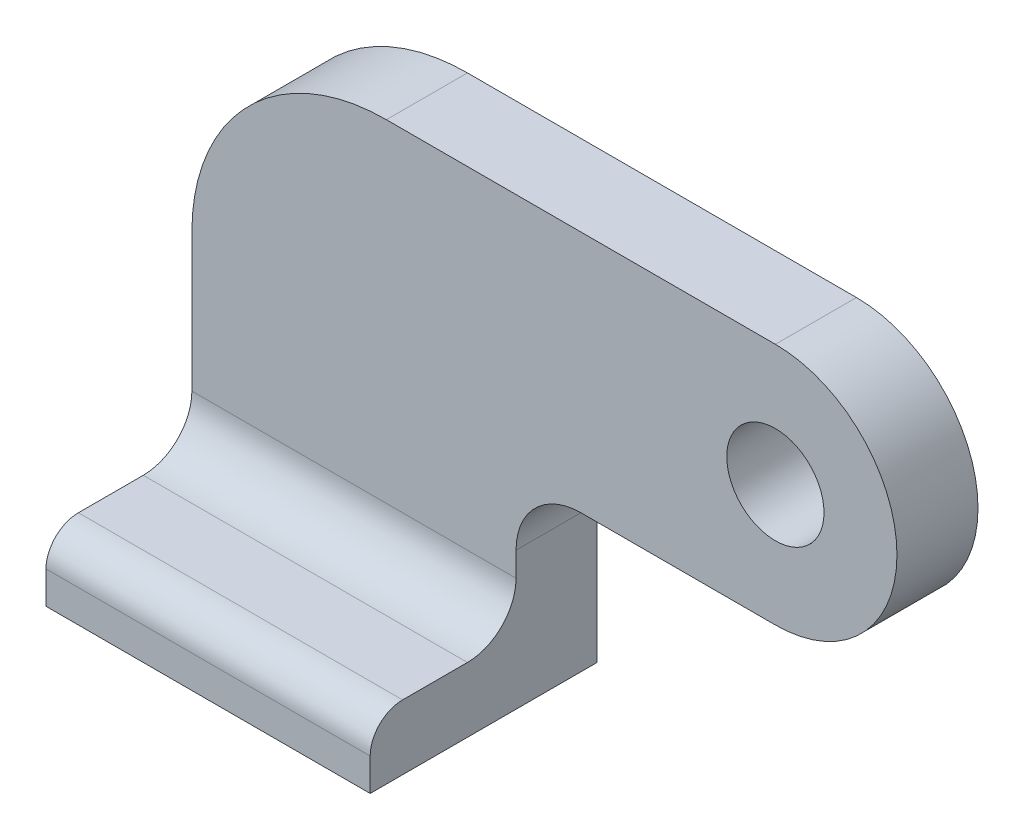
from build123d import *

# Parameters (mm, degrees)
SKETCH2_R           = 9.525
BASE_EXTRUDE_DEPTH  = 15.875
SKETCH3_W           = 63.5
SKETCH3_H           = 12.7
BOSS_EXTRUDE1_DEPTH = 44.45
FILLET1_R           = 6.35
FILLET2_R           = 9.525


with BuildPart() as part:
    # Sketch2 → Base-Extrude (new body)
    with BuildSketch(Plane.XY):
        with BuildLine():
            Line((0, 0), (63.5, 0))
            Line((63.5, 0), (63.5, 26.9875))
            ThreePointArc((63.5, 26.9875), (67.219743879, 35.967756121), (76.2, 39.6875))
            Line((76.2, 39.6875), (114.3, 39.6875))
            ThreePointArc((114.3, 39.6875), (138.1125, 63.5), (114.3, 87.3125))
            Line((114.3, 87.3125), (38.1, 87.3125))
            ThreePointArc((38.1, 87.3125), (11.159231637, 76.153268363), (0, 49.2125))
            Line((0, 49.2125), (0, 0))
        make_face()
        with Locations((114.3, 63.5)):
            Circle(SKETCH2_R, mode=Mode.SUBTRACT)
    extrude(amount=-BASE_EXTRUDE_DEPTH)

    # Sketch3 → Boss-Extrude1 (add)
    with BuildSketch(Plane(origin=(0, 0, -15.875), x_dir=(-1, 0, 0), z_dir=(0, 0, -1))):
        with Locations((-31.75, 6.35)):
            Rectangle(SKETCH3_W, SKETCH3_H)
    extrude(amount=-BOSS_EXTRUDE1_DEPTH)

    # Fillet1
    fillet1_edges = [part.edges().sort_by_distance(p)[0] for p in [
        (31.75, 12.7, 28.575),
    ]]
    fillet(fillet1_edges, radius=FILLET1_R)

    # Fillet2
    fillet2_edges = [part.edges().sort_by_distance(p)[0] for p in [
        (31.75, 12.7, 0),
    ]]
    fillet(fillet2_edges, radius=FILLET2_R)


solid = part.part
